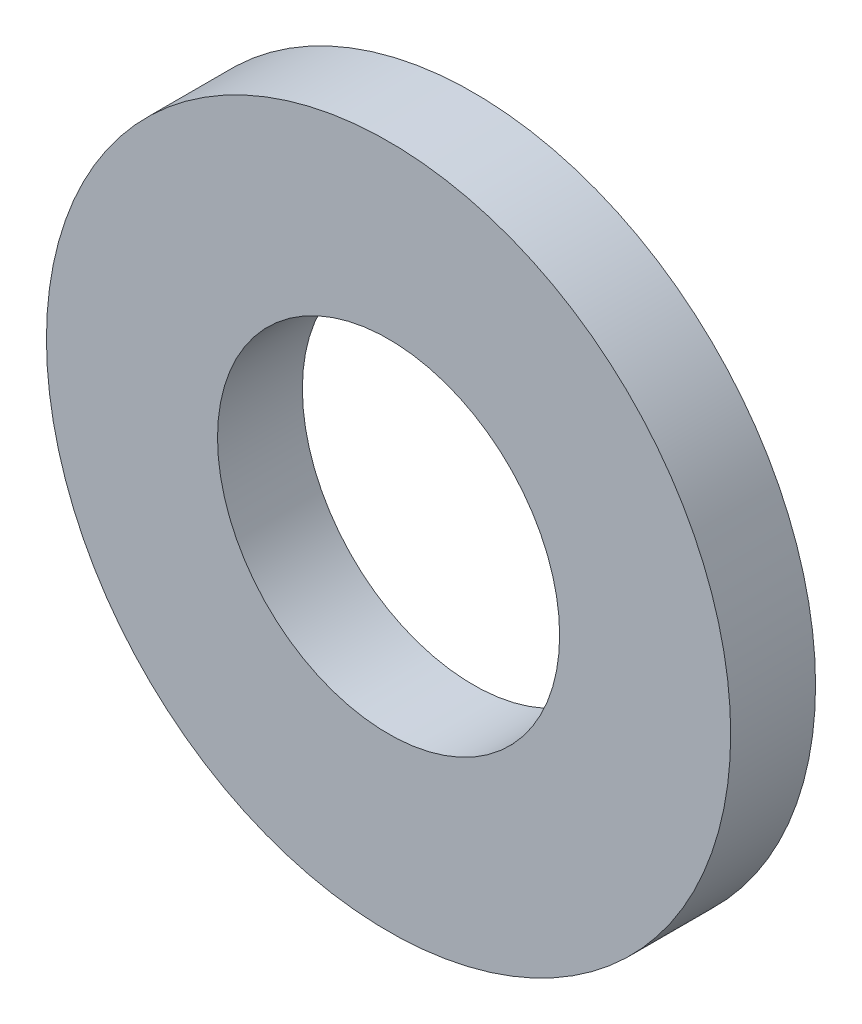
from build123d import *

# Parameters (mm, degrees)
BOSS_EXTRUDE1_DEPTH      = 0.7874
BOSS_EXTRUDE1_DEPTH_BACK = 0.7874
SKETCH1_R                = 6.35
SKETCH1_R_2              = 3.175


with BuildPart() as part:
    # Sketch1 → Boss-Extrude1 (new, two sides: drawn at the far end of the back side and taken through both)
    with BuildSketch(Plane.XY.offset(-BOSS_EXTRUDE1_DEPTH_BACK)):
        Circle(SKETCH1_R)
        Circle(SKETCH1_R_2, mode=Mode.SUBTRACT)
    extrude(amount=BOSS_EXTRUDE1_DEPTH + BOSS_EXTRUDE1_DEPTH_BACK)


solid = part.part
